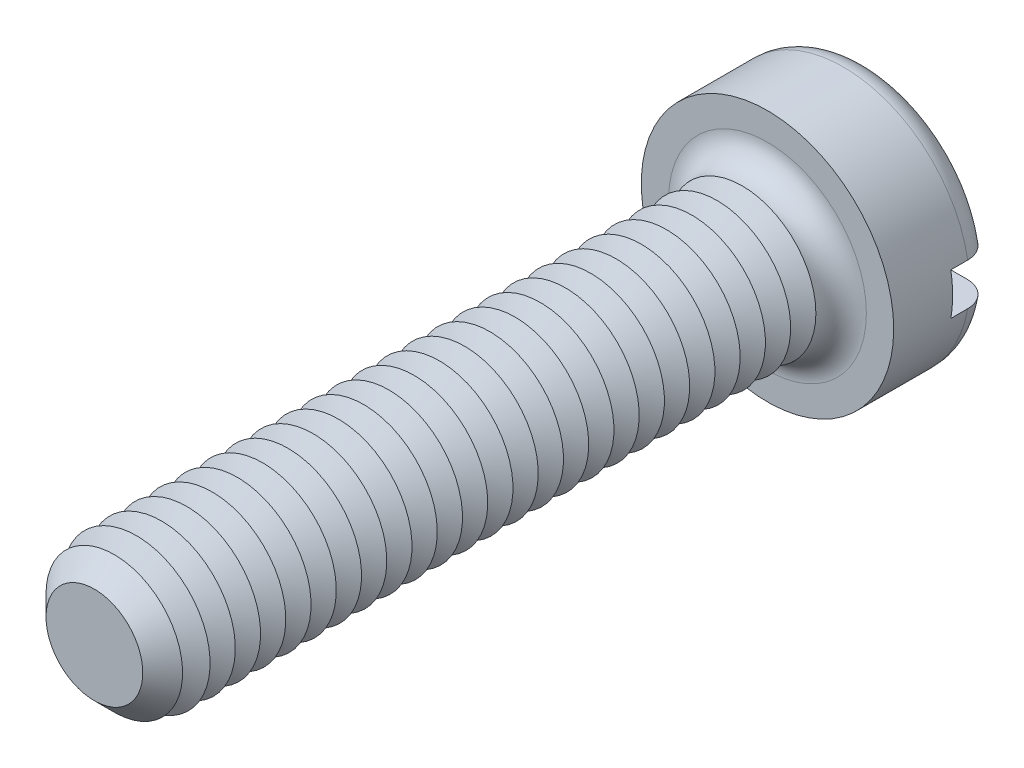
from build123d import *

# Parameters (mm, degrees)
SKETCH3_R           = 3
BOSS_EXTRUDE2_DEPTH = 2.4
SKETCH4_R           = 1.75
BOSS_EXTRUDE3_DEPTH = 16
FILLET1_R           = 0.6
CHAMFER1_SIZE       = 0.6
LPATTERN1_COUNT     = 25
LPATTERN1_PITCH     = 0.6
SKETCH8_W           = 6
SKETCH8_H           = 1
CUT_EXTRUDE1_DEPTH  = 1


with BuildPart() as part:
    # Sketch3 → Boss-Extrude2 (new body)
    with BuildSketch(Plane.XY):
        Circle(SKETCH3_R)
    extrude(amount=-BOSS_EXTRUDE2_DEPTH)

    # Sketch4 → Boss-Extrude3 (add)
    with BuildSketch(Plane.XY):
        Circle(SKETCH4_R)
    extrude(amount=BOSS_EXTRUDE3_DEPTH)

    # Fillet1
    fillet1_edges = [part.edges().sort_by_distance(p)[0] for p in [
        (-3, 0, -2.4),
        (-1.75, 0, 0),
    ]]
    fillet(fillet1_edges, radius=FILLET1_R)

    # Chamfer1
    chamfer1_edges = [part.edges().sort_by_distance(p)[0] for p in [
        (-1.75, 0, 16),
    ]]
    chamfer(chamfer1_edges, length=CHAMFER1_SIZE)

    # Sketch6 → Cut-Revolve1 (revolve, cut)
    with BuildSketch(Plane(origin=(0, 0, 0), x_dir=(0, 0, -1), z_dir=(1, 0, 0)), mode=Mode.PRIVATE) as cut_revolve1_sk:
        Polygon((-0.6, 1.75), (-0.9, 1.230384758), (-1.2, 1.75), align=None)
    cut_revolve1 = revolve(cut_revolve1_sk.sketch.rotate(Axis((0, 0, -1.694361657), (0, 0, 1)), 90), axis=Axis((0, 0, -1.694361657), (0, 0, 1)), mode=Mode.SUBTRACT)

    # LPattern1: Cut-Revolve1 ×25
    with Locations(*[(0, 0, i * LPATTERN1_PITCH) for i in range(1, LPATTERN1_COUNT)]):
        add(cut_revolve1, mode=Mode.SUBTRACT)

    # Sketch8 → Cut-Extrude1 (cut)
    with BuildSketch(Plane(origin=(0, 0, -2.4), x_dir=(-1, 0, 0), z_dir=(0, 0, -1))):
        Rectangle(SKETCH8_W, SKETCH8_H)
    extrude(amount=-CUT_EXTRUDE1_DEPTH, mode=Mode.SUBTRACT)


solid = part.part
